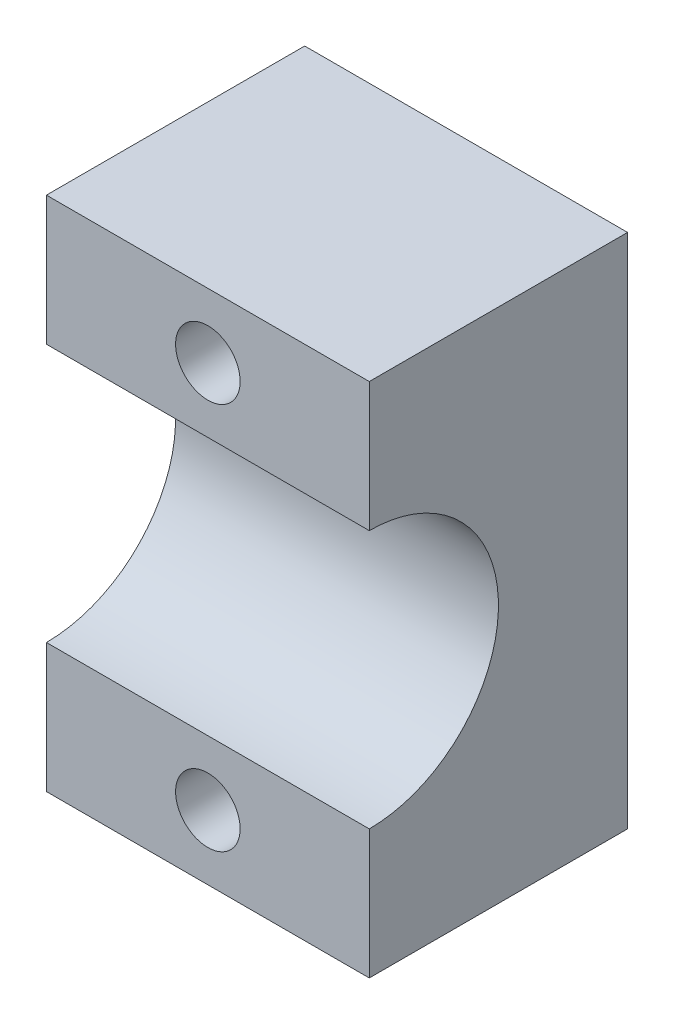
ISO-10303-21;
HEADER;
FILE_DESCRIPTION(('STEP AP214'),'2;1');
FILE_NAME('part.step','',(''),(''),'','','');
FILE_SCHEMA(('AUTOMOTIVE_DESIGN { 1 0 10303 214 1 1 1 1 }'));
ENDSEC;
DATA;
#1=APPLICATION_CONTEXT('core data for automotive mechanical design processes');
#2=APPLICATION_PROTOCOL_DEFINITION('international standard','automotive_design',2000,#1);
#3=PRODUCT_CONTEXT('',#1,'mechanical');
#4=PRODUCT('Part','Part','',(#3));
#5=PRODUCT_RELATED_PRODUCT_CATEGORY('part','',(#4));
#6=PRODUCT_DEFINITION_FORMATION('','',#4);
#7=PRODUCT_DEFINITION_CONTEXT('part definition',#1,'design');
#8=PRODUCT_DEFINITION('design','',#6,#7);
#9=PRODUCT_DEFINITION_SHAPE('','',#8);
#10=(LENGTH_UNIT() NAMED_UNIT(*) SI_UNIT(.MILLI.,.METRE.));
#11=(NAMED_UNIT(*) PLANE_ANGLE_UNIT() SI_UNIT($,.RADIAN.));
#12=(NAMED_UNIT(*) SI_UNIT($,.STERADIAN.) SOLID_ANGLE_UNIT());
#13=UNCERTAINTY_MEASURE_WITH_UNIT(LENGTH_MEASURE(1.E-05),#10,'distance_accuracy_value','');
#14=(GEOMETRIC_REPRESENTATION_CONTEXT(3) GLOBAL_UNCERTAINTY_ASSIGNED_CONTEXT((#13)) GLOBAL_UNIT_ASSIGNED_CONTEXT((#10,
#11,#12)) REPRESENTATION_CONTEXT('',''));
#15=CARTESIAN_POINT('',(0.,0.,0.));
#16=DIRECTION('',(0.,0.,1.));
#17=DIRECTION('',(1.,0.,0.));
#18=AXIS2_PLACEMENT_3D('',#15,#16,#17);
#19=CARTESIAN_POINT('',(0.,0.,8.));
#20=DIRECTION('',(0.,0.,1.));
#21=DIRECTION('',(1.,0.,0.));
#22=AXIS2_PLACEMENT_3D('',#19,#20,#21);
#23=PLANE('',#22);
#24=CARTESIAN_POINT('',(-18.4,-6.,8.));
#25=DIRECTION('',(0.,0.,1.));
#26=DIRECTION('',(1.,0.,0.));
#27=AXIS2_PLACEMENT_3D('',#24,#25,#26);
#28=CIRCLE('',#27,1.);
#29=CARTESIAN_POINT('',(-17.4,-6.,8.));
#30=VERTEX_POINT('',#29);
#31=EDGE_CURVE('E139',#30,#30,#28,.T.);
#32=ORIENTED_EDGE('',*,*,#31,.F.);
#33=EDGE_LOOP('',(#32));
#34=FACE_BOUND('',#33,.T.);
#35=DIRECTION('',(1.,0.,0.));
#36=VECTOR('',#35,1.);
#37=CARTESIAN_POINT('',(-26.4,-4.,8.));
#38=LINE('',#37,#36);
#39=CARTESIAN_POINT('',(-23.4,-4.,8.));
#40=VERTEX_POINT('',#39);
#41=CARTESIAN_POINT('',(-13.4,-4.,8.));
#42=VERTEX_POINT('',#41);
#43=EDGE_CURVE('E11',#40,#42,#38,.T.);
#44=ORIENTED_EDGE('',*,*,#43,.F.);
#45=DIRECTION('',(0.,-1.,0.));
#46=VECTOR('',#45,1.);
#47=CARTESIAN_POINT('',(-23.4,8.,8.));
#48=LINE('',#47,#46);
#49=CARTESIAN_POINT('',(-23.4,-8.,8.));
#50=VERTEX_POINT('',#49);
#51=EDGE_CURVE('E87',#40,#50,#48,.T.);
#52=ORIENTED_EDGE('',*,*,#51,.T.);
#53=DIRECTION('',(1.,0.,0.));
#54=VECTOR('',#53,1.);
#55=CARTESIAN_POINT('',(-23.4,-8.,8.));
#56=LINE('',#55,#54);
#57=CARTESIAN_POINT('',(-13.4,-8.,8.));
#58=VERTEX_POINT('',#57);
#59=EDGE_CURVE('E108',#50,#58,#56,.T.);
#60=ORIENTED_EDGE('',*,*,#59,.T.);
#61=DIRECTION('',(0.,1.,0.));
#62=VECTOR('',#61,1.);
#63=CARTESIAN_POINT('',(-13.4,8.,8.));
#64=LINE('',#63,#62);
#65=EDGE_CURVE('E104',#58,#42,#64,.T.);
#66=ORIENTED_EDGE('',*,*,#65,.T.);
#67=EDGE_LOOP('',(#44,#52,#60,#66));
#68=FACE_BOUND('',#67,.T.);
#69=ADVANCED_FACE('F33',(#34,#68),#23,.T.);
#70=CARTESIAN_POINT('',(-23.4,8.,8.));
#71=DIRECTION('',(1.,0.,0.));
#72=DIRECTION('',(0.,0.,-1.));
#73=AXIS2_PLACEMENT_3D('',#70,#71,#72);
#74=PLANE('',#73);
#75=ORIENTED_EDGE('',*,*,#51,.F.);
#76=CARTESIAN_POINT('',(-23.4,0.,8.));
#77=DIRECTION('',(1.,0.,0.));
#78=DIRECTION('',(0.,0.,-1.));
#79=AXIS2_PLACEMENT_3D('',#76,#77,#78);
#80=CIRCLE('',#79,4.);
#81=CARTESIAN_POINT('',(-23.4,4.,8.));
#82=VERTEX_POINT('',#81);
#83=EDGE_CURVE('E97',#40,#82,#80,.T.);
#84=ORIENTED_EDGE('',*,*,#83,.T.);
#85=CARTESIAN_POINT('',(-23.4,8.,8.));
#86=VERTEX_POINT('',#85);
#87=EDGE_CURVE('E146',#86,#82,#48,.T.);
#88=ORIENTED_EDGE('',*,*,#87,.F.);
#89=DIRECTION('',(0.,0.,-1.));
#90=VECTOR('',#89,1.);
#91=CARTESIAN_POINT('',(-23.4,8.,8.));
#92=LINE('',#91,#90);
#93=CARTESIAN_POINT('',(-23.4,8.,0.));
#94=VERTEX_POINT('',#93);
#95=EDGE_CURVE('E111',#86,#94,#92,.T.);
#96=ORIENTED_EDGE('',*,*,#95,.T.);
#97=DIRECTION('',(0.,-1.,0.));
#98=VECTOR('',#97,1.);
#99=CARTESIAN_POINT('',(-23.4,8.,0.));
#100=LINE('',#99,#98);
#101=CARTESIAN_POINT('',(-23.4,-8.,0.));
#102=VERTEX_POINT('',#101);
#103=EDGE_CURVE('E116',#94,#102,#100,.T.);
#104=ORIENTED_EDGE('',*,*,#103,.T.);
#105=DIRECTION('',(0.,0.,-1.));
#106=VECTOR('',#105,1.);
#107=CARTESIAN_POINT('',(-23.4,-8.,8.));
#108=LINE('',#107,#106);
#109=EDGE_CURVE('E129',#50,#102,#108,.T.);
#110=ORIENTED_EDGE('',*,*,#109,.F.);
#111=EDGE_LOOP('',(#75,#84,#88,#96,#104,#110));
#112=FACE_BOUND('',#111,.T.);
#113=ADVANCED_FACE('F35',(#112),#74,.F.);
#114=CARTESIAN_POINT('',(-23.4,-8.,8.));
#115=DIRECTION('',(0.,1.,0.));
#116=DIRECTION('',(0.,0.,1.));
#117=AXIS2_PLACEMENT_3D('',#114,#115,#116);
#118=PLANE('',#117);
#119=DIRECTION('',(1.,0.,0.));
#120=VECTOR('',#119,1.);
#121=CARTESIAN_POINT('',(-23.4,-8.,0.));
#122=LINE('',#121,#120);
#123=CARTESIAN_POINT('',(-13.4,-8.,0.));
#124=VERTEX_POINT('',#123);
#125=EDGE_CURVE('E119',#102,#124,#122,.T.);
#126=ORIENTED_EDGE('',*,*,#125,.T.);
#127=DIRECTION('',(0.,0.,-1.));
#128=VECTOR('',#127,1.);
#129=CARTESIAN_POINT('',(-13.4,-8.,8.));
#130=LINE('',#129,#128);
#131=EDGE_CURVE('E127',#58,#124,#130,.T.);
#132=ORIENTED_EDGE('',*,*,#131,.F.);
#133=ORIENTED_EDGE('',*,*,#59,.F.);
#134=ORIENTED_EDGE('',*,*,#109,.T.);
#135=EDGE_LOOP('',(#126,#132,#133,#134));
#136=FACE_BOUND('',#135,.T.);
#137=ADVANCED_FACE('F153',(#136),#118,.F.);
#138=CARTESIAN_POINT('',(-13.4,8.,8.));
#139=DIRECTION('',(-1.,0.,0.));
#140=DIRECTION('',(0.,0.,1.));
#141=AXIS2_PLACEMENT_3D('',#138,#139,#140);
#142=PLANE('',#141);
#143=CARTESIAN_POINT('',(-13.4,4.,8.));
#144=VERTEX_POINT('',#143);
#145=CARTESIAN_POINT('',(-13.4,8.,8.));
#146=VERTEX_POINT('',#145);
#147=EDGE_CURVE('E106',#144,#146,#64,.T.);
#148=ORIENTED_EDGE('',*,*,#147,.F.);
#149=CARTESIAN_POINT('',(-13.4,0.,8.));
#150=DIRECTION('',(1.,0.,0.));
#151=DIRECTION('',(0.,0.,-1.));
#152=AXIS2_PLACEMENT_3D('',#149,#150,#151);
#153=CIRCLE('',#152,4.);
#154=EDGE_CURVE('E49',#42,#144,#153,.T.);
#155=ORIENTED_EDGE('',*,*,#154,.F.);
#156=ORIENTED_EDGE('',*,*,#65,.F.);
#157=ORIENTED_EDGE('',*,*,#131,.T.);
#158=DIRECTION('',(0.,1.,0.));
#159=VECTOR('',#158,1.);
#160=CARTESIAN_POINT('',(-13.4,8.,0.));
#161=LINE('',#160,#159);
#162=CARTESIAN_POINT('',(-13.4,8.,0.));
#163=VERTEX_POINT('',#162);
#164=EDGE_CURVE('E121',#124,#163,#161,.T.);
#165=ORIENTED_EDGE('',*,*,#164,.T.);
#166=DIRECTION('',(0.,0.,-1.));
#167=VECTOR('',#166,1.);
#168=CARTESIAN_POINT('',(-13.4,8.,8.));
#169=LINE('',#168,#167);
#170=EDGE_CURVE('E125',#146,#163,#169,.T.);
#171=ORIENTED_EDGE('',*,*,#170,.F.);
#172=EDGE_LOOP('',(#148,#155,#156,#157,#165,#171));
#173=FACE_BOUND('',#172,.T.);
#174=ADVANCED_FACE('F102',(#173),#142,.F.);
#175=CARTESIAN_POINT('',(-23.4,8.,8.));
#176=DIRECTION('',(0.,-1.,0.));
#177=DIRECTION('',(0.,0.,-1.));
#178=AXIS2_PLACEMENT_3D('',#175,#176,#177);
#179=PLANE('',#178);
#180=DIRECTION('',(-1.,0.,0.));
#181=VECTOR('',#180,1.);
#182=CARTESIAN_POINT('',(-23.4,8.,0.));
#183=LINE('',#182,#181);
#184=EDGE_CURVE('E79',#163,#94,#183,.T.);
#185=ORIENTED_EDGE('',*,*,#184,.T.);
#186=ORIENTED_EDGE('',*,*,#95,.F.);
#187=DIRECTION('',(-1.,0.,0.));
#188=VECTOR('',#187,1.);
#189=CARTESIAN_POINT('',(-23.4,8.,8.));
#190=LINE('',#189,#188);
#191=EDGE_CURVE('E58',#146,#86,#190,.T.);
#192=ORIENTED_EDGE('',*,*,#191,.F.);
#193=ORIENTED_EDGE('',*,*,#170,.T.);
#194=EDGE_LOOP('',(#185,#186,#192,#193));
#195=FACE_BOUND('',#194,.T.);
#196=ADVANCED_FACE('F166',(#195),#179,.F.);
#197=CARTESIAN_POINT('',(-18.4,6.,8.));
#198=DIRECTION('',(0.,0.,1.));
#199=DIRECTION('',(1.,0.,0.));
#200=AXIS2_PLACEMENT_3D('',#197,#198,#199);
#201=CIRCLE('',#200,1.);
#202=CARTESIAN_POINT('',(-17.4,6.,8.));
#203=VERTEX_POINT('',#202);
#204=EDGE_CURVE('E134',#203,#203,#201,.T.);
#205=ORIENTED_EDGE('',*,*,#204,.F.);
#206=EDGE_LOOP('',(#205));
#207=FACE_BOUND('',#206,.T.);
#208=DIRECTION('',(1.,0.,0.));
#209=VECTOR('',#208,1.);
#210=CARTESIAN_POINT('',(-26.4,4.,8.));
#211=LINE('',#210,#209);
#212=EDGE_CURVE('E42',#144,#82,#211,.F.);
#213=ORIENTED_EDGE('',*,*,#212,.F.);
#214=ORIENTED_EDGE('',*,*,#147,.T.);
#215=ORIENTED_EDGE('',*,*,#191,.T.);
#216=ORIENTED_EDGE('',*,*,#87,.T.);
#217=EDGE_LOOP('',(#213,#214,#215,#216));
#218=FACE_BOUND('',#217,.T.);
#219=ADVANCED_FACE('F148',(#207,#218),#23,.T.);
#220=CARTESIAN_POINT('',(0.,0.,0.));
#221=DIRECTION('',(0.,0.,1.));
#222=DIRECTION('',(1.,0.,0.));
#223=AXIS2_PLACEMENT_3D('',#220,#221,#222);
#224=PLANE('',#223);
#225=CARTESIAN_POINT('',(-18.4,6.,0.));
#226=DIRECTION('',(0.,0.,1.));
#227=DIRECTION('',(1.,0.,0.));
#228=AXIS2_PLACEMENT_3D('',#225,#226,#227);
#229=CIRCLE('',#228,1.);
#230=CARTESIAN_POINT('',(-17.4,6.,0.));
#231=VERTEX_POINT('',#230);
#232=EDGE_CURVE('E37',#231,#231,#229,.T.);
#233=ORIENTED_EDGE('',*,*,#232,.T.);
#234=EDGE_LOOP('',(#233));
#235=FACE_BOUND('',#234,.T.);
#236=CARTESIAN_POINT('',(-18.4,-6.,0.));
#237=DIRECTION('',(0.,0.,1.));
#238=DIRECTION('',(1.,0.,0.));
#239=AXIS2_PLACEMENT_3D('',#236,#237,#238);
#240=CIRCLE('',#239,1.);
#241=CARTESIAN_POINT('',(-17.4,-6.,0.));
#242=VERTEX_POINT('',#241);
#243=EDGE_CURVE('E132',#242,#242,#240,.T.);
#244=ORIENTED_EDGE('',*,*,#243,.T.);
#245=EDGE_LOOP('',(#244));
#246=FACE_BOUND('',#245,.T.);
#247=ORIENTED_EDGE('',*,*,#103,.F.);
#248=ORIENTED_EDGE('',*,*,#184,.F.);
#249=ORIENTED_EDGE('',*,*,#164,.F.);
#250=ORIENTED_EDGE('',*,*,#125,.F.);
#251=EDGE_LOOP('',(#247,#248,#249,#250));
#252=FACE_BOUND('',#251,.T.);
#253=ADVANCED_FACE('F156',(#235,#246,#252),#224,.F.);
#254=CARTESIAN_POINT('',(-26.4,0.,8.));
#255=DIRECTION('',(1.,0.,0.));
#256=DIRECTION('',(0.,0.,-1.));
#257=AXIS2_PLACEMENT_3D('',#254,#255,#256);
#258=CYLINDRICAL_SURFACE('',#257,4.);
#259=ORIENTED_EDGE('',*,*,#43,.T.);
#260=ORIENTED_EDGE('',*,*,#154,.T.);
#261=ORIENTED_EDGE('',*,*,#212,.T.);
#262=ORIENTED_EDGE('',*,*,#83,.F.);
#263=EDGE_LOOP('',(#259,#260,#261,#262));
#264=FACE_BOUND('',#263,.T.);
#265=ADVANCED_FACE('F95',(#264),#258,.F.);
#266=CARTESIAN_POINT('',(-18.4,-6.,-5.));
#267=DIRECTION('',(0.,0.,1.));
#268=DIRECTION('',(1.,0.,0.));
#269=AXIS2_PLACEMENT_3D('',#266,#267,#268);
#270=CYLINDRICAL_SURFACE('',#269,1.);
#271=CARTESIAN_POINT('',(-17.4,-6.,8.));
#272=CARTESIAN_POINT('',(-17.4,-6.,7.91666666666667));
#273=CARTESIAN_POINT('',(-17.4,-6.,7.83333333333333));
#274=CARTESIAN_POINT('',(-17.4,-6.,7.66666666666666));
#275=CARTESIAN_POINT('',(-17.4,-6.,7.58333333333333));
#276=CARTESIAN_POINT('',(-17.4,-6.,7.41666666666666));
#277=CARTESIAN_POINT('',(-17.4,-6.,7.33333333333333));
#278=CARTESIAN_POINT('',(-17.4,-6.,7.16666666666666));
#279=CARTESIAN_POINT('',(-17.4,-6.,7.08333333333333));
#280=CARTESIAN_POINT('',(-17.4,-6.,6.91666666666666));
#281=CARTESIAN_POINT('',(-17.4,-6.,6.83333333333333));
#282=CARTESIAN_POINT('',(-17.4,-6.,6.66666666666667));
#283=CARTESIAN_POINT('',(-17.4,-6.,6.58333333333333));
#284=CARTESIAN_POINT('',(-17.4,-6.,6.41666666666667));
#285=CARTESIAN_POINT('',(-17.4,-6.,6.33333333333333));
#286=CARTESIAN_POINT('',(-17.4,-6.,6.16666666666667));
#287=CARTESIAN_POINT('',(-17.4,-6.,6.08333333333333));
#288=CARTESIAN_POINT('',(-17.4,-6.,5.91666666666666));
#289=CARTESIAN_POINT('',(-17.4,-6.,5.83333333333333));
#290=CARTESIAN_POINT('',(-17.4,-6.,5.66666666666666));
#291=CARTESIAN_POINT('',(-17.4,-6.,5.58333333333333));
#292=CARTESIAN_POINT('',(-17.4,-6.,5.41666666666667));
#293=CARTESIAN_POINT('',(-17.4,-6.,5.33333333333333));
#294=CARTESIAN_POINT('',(-17.4,-6.,5.16666666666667));
#295=CARTESIAN_POINT('',(-17.4,-6.,5.08333333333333));
#296=CARTESIAN_POINT('',(-17.4,-6.,4.91666666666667));
#297=CARTESIAN_POINT('',(-17.4,-6.,4.83333333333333));
#298=CARTESIAN_POINT('',(-17.4,-6.,4.66666666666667));
#299=CARTESIAN_POINT('',(-17.4,-6.,4.58333333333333));
#300=CARTESIAN_POINT('',(-17.4,-6.,4.41666666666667));
#301=CARTESIAN_POINT('',(-17.4,-6.,4.33333333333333));
#302=CARTESIAN_POINT('',(-17.4,-6.,4.16666666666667));
#303=CARTESIAN_POINT('',(-17.4,-6.,4.08333333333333));
#304=CARTESIAN_POINT('',(-17.4,-6.,3.91666666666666));
#305=CARTESIAN_POINT('',(-17.4,-6.,3.83333333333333));
#306=CARTESIAN_POINT('',(-17.4,-6.,3.66666666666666));
#307=CARTESIAN_POINT('',(-17.4,-6.,3.58333333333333));
#308=CARTESIAN_POINT('',(-17.4,-6.,3.41666666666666));
#309=CARTESIAN_POINT('',(-17.4,-6.,3.33333333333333));
#310=CARTESIAN_POINT('',(-17.4,-6.,3.16666666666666));
#311=CARTESIAN_POINT('',(-17.4,-6.,3.08333333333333));
#312=CARTESIAN_POINT('',(-17.4,-6.,2.91666666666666));
#313=CARTESIAN_POINT('',(-17.4,-6.,2.83333333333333));
#314=CARTESIAN_POINT('',(-17.4,-6.,2.66666666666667));
#315=CARTESIAN_POINT('',(-17.4,-6.,2.58333333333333));
#316=CARTESIAN_POINT('',(-17.4,-6.,2.41666666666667));
#317=CARTESIAN_POINT('',(-17.4,-6.,2.33333333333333));
#318=CARTESIAN_POINT('',(-17.4,-6.,2.16666666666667));
#319=CARTESIAN_POINT('',(-17.4,-6.,2.08333333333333));
#320=CARTESIAN_POINT('',(-17.4,-6.,1.91666666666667));
#321=CARTESIAN_POINT('',(-17.4,-6.,1.83333333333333));
#322=CARTESIAN_POINT('',(-17.4,-6.,1.66666666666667));
#323=CARTESIAN_POINT('',(-17.4,-6.,1.58333333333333));
#324=CARTESIAN_POINT('',(-17.4,-6.,1.41666666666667));
#325=CARTESIAN_POINT('',(-17.4,-6.,1.33333333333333));
#326=CARTESIAN_POINT('',(-17.4,-6.,1.16666666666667));
#327=CARTESIAN_POINT('',(-17.4,-6.,1.08333333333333));
#328=CARTESIAN_POINT('',(-17.4,-6.,0.916666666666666));
#329=CARTESIAN_POINT('',(-17.4,-6.,0.833333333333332));
#330=CARTESIAN_POINT('',(-17.4,-6.,0.666666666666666));
#331=CARTESIAN_POINT('',(-17.4,-6.,0.583333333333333));
#332=CARTESIAN_POINT('',(-17.4,-6.,0.416666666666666));
#333=CARTESIAN_POINT('',(-17.4,-6.,0.333333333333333));
#334=CARTESIAN_POINT('',(-17.4,-6.,0.166666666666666));
#335=CARTESIAN_POINT('',(-17.4,-6.,0.0833333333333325));
#336=CARTESIAN_POINT('',(-17.4,-6.,0.));
#337=B_SPLINE_CURVE_WITH_KNOTS('',3,(#271,#272,#273,#274,#275,#276,#277,#278,#279,#280,#281,
#282,#283,#284,#285,#286,#287,#288,#289,#290,#291,#292,#293,#294,#295,#296,#297,#298,#299,#300,
#301,#302,#303,#304,#305,#306,#307,#308,#309,#310,#311,#312,#313,#314,#315,#316,#317,#318,#319,
#320,#321,#322,#323,#324,#325,#326,#327,#328,#329,#330,#331,#332,#333,#334,#335,#336),
.UNSPECIFIED.,.F.,.F.,(4,2,2,2,2,2,2,2,2,2,2,2,2,2,2,2,2,2,2,2,2,2,2,2,2,2,2,2,2,2,2,2,4),(0.,
0.25,0.5,0.750000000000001,1.,1.25,1.5,1.75,2.,2.25,2.5,2.75,3.,3.25,3.5,3.75,4.,4.25,4.5,4.75,
5.,5.25,5.5,5.75,6.,6.25,6.5,6.75,7.,7.25,7.5,7.75,8.),.UNSPECIFIED.);
#338=EDGE_CURVE('BSEAM164',#30,#242,#337,.T.);
#339=ORIENTED_EDGE('',*,*,#31,.T.);
#340=ORIENTED_EDGE('',*,*,#243,.F.);
#341=ORIENTED_EDGE('',*,*,#338,.T.);
#342=ORIENTED_EDGE('',*,*,#338,.F.);
#343=EDGE_LOOP('',(#339,#341,#340,#342));
#344=FACE_BOUND('',#343,.T.);
#345=ADVANCED_FACE('F164',(#344),#270,.F.);
#346=CARTESIAN_POINT('',(-18.4,6.,-5.));
#347=DIRECTION('',(0.,0.,1.));
#348=DIRECTION('',(1.,0.,0.));
#349=AXIS2_PLACEMENT_3D('',#346,#347,#348);
#350=CYLINDRICAL_SURFACE('',#349,1.);
#351=CARTESIAN_POINT('',(-17.4,6.,8.));
#352=CARTESIAN_POINT('',(-17.4,6.,7.91666666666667));
#353=CARTESIAN_POINT('',(-17.4,6.,7.83333333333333));
#354=CARTESIAN_POINT('',(-17.4,6.,7.66666666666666));
#355=CARTESIAN_POINT('',(-17.4,6.,7.58333333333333));
#356=CARTESIAN_POINT('',(-17.4,6.,7.41666666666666));
#357=CARTESIAN_POINT('',(-17.4,6.,7.33333333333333));
#358=CARTESIAN_POINT('',(-17.4,6.,7.16666666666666));
#359=CARTESIAN_POINT('',(-17.4,6.,7.08333333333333));
#360=CARTESIAN_POINT('',(-17.4,6.,6.91666666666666));
#361=CARTESIAN_POINT('',(-17.4,6.,6.83333333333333));
#362=CARTESIAN_POINT('',(-17.4,6.,6.66666666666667));
#363=CARTESIAN_POINT('',(-17.4,6.,6.58333333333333));
#364=CARTESIAN_POINT('',(-17.4,6.,6.41666666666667));
#365=CARTESIAN_POINT('',(-17.4,6.,6.33333333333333));
#366=CARTESIAN_POINT('',(-17.4,6.,6.16666666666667));
#367=CARTESIAN_POINT('',(-17.4,6.,6.08333333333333));
#368=CARTESIAN_POINT('',(-17.4,6.,5.91666666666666));
#369=CARTESIAN_POINT('',(-17.4,6.,5.83333333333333));
#370=CARTESIAN_POINT('',(-17.4,6.,5.66666666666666));
#371=CARTESIAN_POINT('',(-17.4,6.,5.58333333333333));
#372=CARTESIAN_POINT('',(-17.4,6.,5.41666666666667));
#373=CARTESIAN_POINT('',(-17.4,6.,5.33333333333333));
#374=CARTESIAN_POINT('',(-17.4,6.,5.16666666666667));
#375=CARTESIAN_POINT('',(-17.4,6.,5.08333333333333));
#376=CARTESIAN_POINT('',(-17.4,6.,4.91666666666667));
#377=CARTESIAN_POINT('',(-17.4,6.,4.83333333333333));
#378=CARTESIAN_POINT('',(-17.4,6.,4.66666666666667));
#379=CARTESIAN_POINT('',(-17.4,6.,4.58333333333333));
#380=CARTESIAN_POINT('',(-17.4,6.,4.41666666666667));
#381=CARTESIAN_POINT('',(-17.4,6.,4.33333333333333));
#382=CARTESIAN_POINT('',(-17.4,6.,4.16666666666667));
#383=CARTESIAN_POINT('',(-17.4,6.,4.08333333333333));
#384=CARTESIAN_POINT('',(-17.4,6.,3.91666666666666));
#385=CARTESIAN_POINT('',(-17.4,6.,3.83333333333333));
#386=CARTESIAN_POINT('',(-17.4,6.,3.66666666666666));
#387=CARTESIAN_POINT('',(-17.4,6.,3.58333333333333));
#388=CARTESIAN_POINT('',(-17.4,6.,3.41666666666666));
#389=CARTESIAN_POINT('',(-17.4,6.,3.33333333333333));
#390=CARTESIAN_POINT('',(-17.4,6.,3.16666666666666));
#391=CARTESIAN_POINT('',(-17.4,6.,3.08333333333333));
#392=CARTESIAN_POINT('',(-17.4,6.,2.91666666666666));
#393=CARTESIAN_POINT('',(-17.4,6.,2.83333333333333));
#394=CARTESIAN_POINT('',(-17.4,6.,2.66666666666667));
#395=CARTESIAN_POINT('',(-17.4,6.,2.58333333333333));
#396=CARTESIAN_POINT('',(-17.4,6.,2.41666666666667));
#397=CARTESIAN_POINT('',(-17.4,6.,2.33333333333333));
#398=CARTESIAN_POINT('',(-17.4,6.,2.16666666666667));
#399=CARTESIAN_POINT('',(-17.4,6.,2.08333333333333));
#400=CARTESIAN_POINT('',(-17.4,6.,1.91666666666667));
#401=CARTESIAN_POINT('',(-17.4,6.,1.83333333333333));
#402=CARTESIAN_POINT('',(-17.4,6.,1.66666666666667));
#403=CARTESIAN_POINT('',(-17.4,6.,1.58333333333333));
#404=CARTESIAN_POINT('',(-17.4,6.,1.41666666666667));
#405=CARTESIAN_POINT('',(-17.4,6.,1.33333333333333));
#406=CARTESIAN_POINT('',(-17.4,6.,1.16666666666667));
#407=CARTESIAN_POINT('',(-17.4,6.,1.08333333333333));
#408=CARTESIAN_POINT('',(-17.4,6.,0.916666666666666));
#409=CARTESIAN_POINT('',(-17.4,6.,0.833333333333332));
#410=CARTESIAN_POINT('',(-17.4,6.,0.666666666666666));
#411=CARTESIAN_POINT('',(-17.4,6.,0.583333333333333));
#412=CARTESIAN_POINT('',(-17.4,6.,0.416666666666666));
#413=CARTESIAN_POINT('',(-17.4,6.,0.333333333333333));
#414=CARTESIAN_POINT('',(-17.4,6.,0.166666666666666));
#415=CARTESIAN_POINT('',(-17.4,6.,0.0833333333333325));
#416=CARTESIAN_POINT('',(-17.4,6.,0.));
#417=B_SPLINE_CURVE_WITH_KNOTS('',3,(#351,#352,#353,#354,#355,#356,#357,#358,#359,#360,#361,
#362,#363,#364,#365,#366,#367,#368,#369,#370,#371,#372,#373,#374,#375,#376,#377,#378,#379,#380,
#381,#382,#383,#384,#385,#386,#387,#388,#389,#390,#391,#392,#393,#394,#395,#396,#397,#398,#399,
#400,#401,#402,#403,#404,#405,#406,#407,#408,#409,#410,#411,#412,#413,#414,#415,#416),
.UNSPECIFIED.,.F.,.F.,(4,2,2,2,2,2,2,2,2,2,2,2,2,2,2,2,2,2,2,2,2,2,2,2,2,2,2,2,2,2,2,2,4),(0.,
0.25,0.5,0.750000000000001,1.,1.25,1.5,1.75,2.,2.25,2.5,2.75,3.,3.25,3.5,3.75,4.,4.25,4.5,4.75,
5.,5.25,5.5,5.75,6.,6.25,6.5,6.75,7.,7.25,7.5,7.75,8.),.UNSPECIFIED.);
#418=EDGE_CURVE('BSEAM179',#203,#231,#417,.T.);
#419=ORIENTED_EDGE('',*,*,#204,.T.);
#420=ORIENTED_EDGE('',*,*,#232,.F.);
#421=ORIENTED_EDGE('',*,*,#418,.T.);
#422=ORIENTED_EDGE('',*,*,#418,.F.);
#423=EDGE_LOOP('',(#419,#421,#420,#422));
#424=FACE_BOUND('',#423,.T.);
#425=ADVANCED_FACE('F179',(#424),#350,.F.);
#426=CLOSED_SHELL('',(#69,#113,#137,#174,#196,#219,#253,#265,#345,#425));
#427=MANIFOLD_SOLID_BREP('B2',#426);
#428=ADVANCED_BREP_SHAPE_REPRESENTATION('',(#18,#427),#14);
#429=SHAPE_DEFINITION_REPRESENTATION(#9,#428);
ENDSEC;
END-ISO-10303-21;
